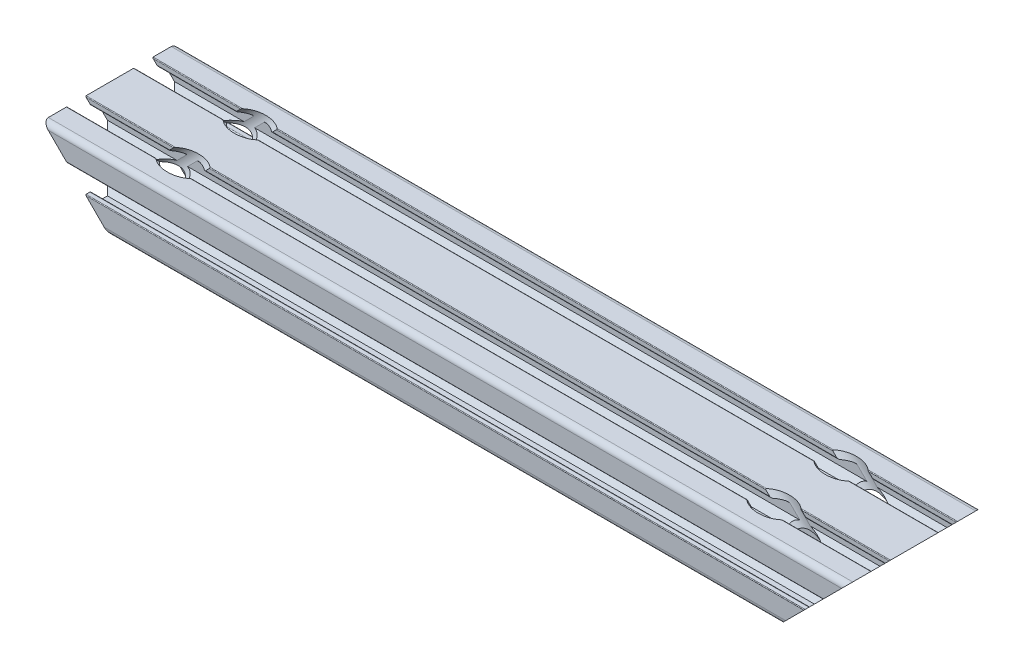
from build123d import *

# Parameters (mm, degrees)
MODEL_R                                 = 3.100002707
MODEL_R_2                               = 3.10000253
F_30_SARJA_1_0012_30X60_1_DEPTH         = 360
CUT_EXTRUDE1_DEPTH                      = 191.328663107
F_8_5_8_5_DIAMETER_HOLE1_D              = 8.5
CBORE_FOR_M8_HEX_HEAD_BOLT2_D           = 8.4
CBORE_FOR_M8_HEX_HEAD_BOLT2_CBORE_D     = 14
CBORE_FOR_M8_HEX_HEAD_BOLT2_CBORE_DEPTH = 30


with BuildPart() as part:
    # Model → 30-sarja 1.0012 30X60_1 (new body)
    with BuildSketch(Plane(origin=(180, 0, 0), x_dir=(0, 1, 0), z_dir=(-1, 0, 0))):
        with BuildLine():
            Line((-6.799995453, -22.860655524), (-3.939340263, -19.999999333))
            Line((-3.939340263, -19.999999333), (3.939341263, -19.999999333))
            Line((3.939341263, -19.999999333), (6.799995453, -22.860655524))
            Line((6.799995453, -22.860655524), (6.799995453, -27.200002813))
            ThreePointArc((6.799995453, -27.200002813), (6.712129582, -27.412131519), (6.500001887, -27.499999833))
            Line((6.500001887, -27.499999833), (4.60000176, -27.499999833))
            ThreePointArc((4.60000176, -27.499999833), (4.246448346, -27.646446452), (4.100001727, -27.999999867))
            Line((4.100001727, -27.999999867), (4.100001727, -29.69999698))
            ThreePointArc((4.100001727, -29.69999698), (4.187865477, -29.912129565), (4.399995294, -30))
            Line((4.399995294, -30), (12.499999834, -30))
            ThreePointArc((12.499999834, -30), (14.267766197, -29.267767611), (15, -27.500001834))
            Line((15, -27.500001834), (15, -19.400000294))
            ThreePointArc((15, -19.400000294), (14.912132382, -19.187867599), (14.69999998, -19.099999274))
            Line((14.69999998, -19.099999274), (12.999999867, -19.099999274))
            ThreePointArc((12.999999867, -19.099999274), (12.646446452, -19.246445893), (12.499999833, -19.599999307))
            Line((12.499999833, -19.599999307), (12.499999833, -21.499999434))
            ThreePointArc((12.499999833, -21.499999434), (12.41213274, -21.712129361), (12.200002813, -21.799996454))
            Line((12.200002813, -21.799996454), (7.860654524, -21.799996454))
            Line((7.860654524, -21.799996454), (4.999999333, -18.939341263))
            Line((4.999999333, -18.939341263), (4.999999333, -11.060659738))
            Line((4.999999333, -11.060659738), (7.860654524, -8.200005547))
            Line((7.860654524, -8.200005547), (12.200002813, -8.200005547))
            ThreePointArc((12.200002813, -8.200005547), (12.41213274, -8.28787264), (12.499999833, -8.500002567))
            Line((12.499999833, -8.500002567), (12.499999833, -10.400002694))
            ThreePointArc((12.499999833, -10.400002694), (12.646447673, -10.753553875), (12.999999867, -10.899999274))
            Line((12.999999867, -10.899999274), (14.70000098, -10.899999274))
            ThreePointArc((14.70000098, -10.899999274), (14.912131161, -10.81213217), (15, -10.600002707))
            Line((15, -10.600002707), (15, 10.600002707))
            ThreePointArc((15, 10.600002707), (14.912132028, 10.812134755), (14.69999998, 10.900002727))
            Line((14.69999998, 10.900002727), (12.999999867, 10.900002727))
            ThreePointArc((12.999999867, 10.900002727), (12.646446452, 10.753556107), (12.499999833, 10.400002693))
            Line((12.499999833, 10.400002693), (12.499999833, 8.500002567))
            ThreePointArc((12.499999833, 8.500002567), (12.41213274, 8.287872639), (12.200002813, 8.200005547))
            Line((12.200002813, 8.200005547), (7.860654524, 8.200005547))
            Line((7.860654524, 8.200005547), (4.999999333, 11.060661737))
            Line((4.999999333, 11.060661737), (4.999999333, 18.939340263))
            Line((4.999999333, 18.939340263), (7.860654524, 21.799996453))
            Line((7.860654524, 21.799996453), (12.200002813, 21.799996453))
            ThreePointArc((12.200002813, 21.799996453), (12.41213274, 21.712129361), (12.499999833, 21.499999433))
            Line((12.499999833, 21.499999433), (12.499999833, 19.599999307))
            ThreePointArc((12.499999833, 19.599999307), (12.646447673, 19.246448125), (12.999999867, 19.100002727))
            Line((12.999999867, 19.100002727), (14.70000098, 19.100002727))
            ThreePointArc((14.70000098, 19.100002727), (14.912131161, 19.187869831), (15, 19.399999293))
            Line((15, 19.399999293), (15, 27.500001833))
            ThreePointArc((15, 27.500001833), (14.267766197, 29.267767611), (12.499999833, 30))
            Line((12.499999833, 30), (4.399993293, 30))
            ThreePointArc((4.399993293, 30), (4.187866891, 29.912130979), (4.100001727, 29.70000298))
            Line((4.100001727, 29.70000298), (4.100001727, 27.999999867))
            ThreePointArc((4.100001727, 27.999999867), (4.246448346, 27.646446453), (4.60000176, 27.499999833))
            Line((4.60000176, 27.499999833), (6.500001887, 27.499999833))
            ThreePointArc((6.500001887, 27.499999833), (6.712129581, 27.41213152), (6.799995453, 27.200002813))
            Line((6.799995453, 27.200002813), (6.799995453, 22.860656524))
            Line((6.799995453, 22.860656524), (3.939341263, 19.999999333))
            Line((3.939341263, 19.999999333), (-3.939340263, 19.999999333))
            Line((-3.939340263, 19.999999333), (-6.799995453, 22.860656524))
            Line((-6.799995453, 22.860656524), (-6.799995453, 27.200002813))
            ThreePointArc((-6.799995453, 27.200002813), (-6.712128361, 27.41213274), (-6.499998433, 27.499999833))
            Line((-6.499998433, 27.499999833), (-4.599998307, 27.499999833))
            ThreePointArc((-4.599998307, 27.499999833), (-4.246444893, 27.646446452), (-4.099998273, 27.999999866))
            Line((-4.099998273, 27.999999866), (-4.099998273, 29.69999698))
            ThreePointArc((-4.099998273, 29.69999698), (-4.187863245, 29.912130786), (-4.399995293, 30))
            Line((-4.399995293, 30), (-12.499999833, 30))
            ThreePointArc((-12.499999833, 30), (-14.267766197, 29.267767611), (-15, 27.500001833))
            Line((-15, 27.500001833), (-15, 19.399999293))
            ThreePointArc((-15, 19.399999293), (-14.912130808, 19.187869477), (-14.69999998, 19.100002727))
            Line((-14.69999998, 19.100002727), (-12.999999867, 19.100002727))
            ThreePointArc((-12.999999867, 19.100002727), (-12.646446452, 19.246449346), (-12.499999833, 19.60000276))
            Line((-12.499999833, 19.60000276), (-12.499999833, 21.500002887))
            ThreePointArc((-12.499999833, 21.500002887), (-12.41213152, 21.712130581), (-12.200002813, 21.799996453))
            Line((-12.200002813, 21.799996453), (-7.860655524, 21.799996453))
            Line((-7.860655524, 21.799996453), (-4.999999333, 18.939340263))
            Line((-4.999999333, 18.939340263), (-4.999999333, 11.060661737))
            Line((-4.999999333, 11.060661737), (-7.860655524, 8.200005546))
            Line((-7.860655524, 8.200005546), (-12.200002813, 8.200005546))
            ThreePointArc((-12.200002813, 8.200005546), (-12.41213274, 8.287872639), (-12.499999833, 8.500002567))
            Line((-12.499999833, 8.500002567), (-12.499999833, 10.400002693))
            ThreePointArc((-12.499999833, 10.400002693), (-12.646446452, 10.753556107), (-12.999999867, 10.900002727))
            Line((-12.999999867, 10.900002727), (-14.69999998, 10.900002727))
            ThreePointArc((-14.69999998, 10.900002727), (-14.912132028, 10.812134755), (-15, 10.600002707))
            Line((-15, 10.600002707), (-15, -10.600002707))
            ThreePointArc((-15, -10.600002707), (-14.912130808, -10.812132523), (-14.69999998, -10.899999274))
            Line((-14.69999998, -10.899999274), (-12.999999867, -10.899999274))
            ThreePointArc((-12.999999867, -10.899999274), (-12.646446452, -10.753552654), (-12.499999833, -10.39999924))
            Line((-12.499999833, -10.39999924), (-12.499999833, -8.499999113))
            ThreePointArc((-12.499999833, -8.499999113), (-12.41213152, -8.287871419), (-12.200002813, -8.200005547))
            Line((-12.200002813, -8.200005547), (-7.860655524, -8.200005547))
            Line((-7.860655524, -8.200005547), (-4.999999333, -11.060659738))
            Line((-4.999999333, -11.060659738), (-4.999999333, -18.939341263))
            Line((-4.999999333, -18.939341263), (-7.860655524, -21.799996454))
            Line((-7.860655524, -21.799996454), (-12.200002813, -21.799996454))
            ThreePointArc((-12.200002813, -21.799996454), (-12.41213274, -21.712129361), (-12.499999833, -21.499999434))
            Line((-12.499999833, -21.499999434), (-12.499999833, -19.599999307))
            ThreePointArc((-12.499999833, -19.599999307), (-12.646446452, -19.246445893), (-12.999999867, -19.099999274))
            Line((-12.999999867, -19.099999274), (-14.69999998, -19.099999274))
            ThreePointArc((-14.69999998, -19.099999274), (-14.912132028, -19.187867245), (-15, -19.399999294))
            Line((-15, -19.399999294), (-15, -27.500001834))
            ThreePointArc((-15, -27.500001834), (-14.267766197, -29.267767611), (-12.499999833, -30))
            Line((-12.499999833, -30), (-4.399993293, -30))
            ThreePointArc((-4.399993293, -30), (-4.187864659, -29.9121322), (-4.099998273, -29.70000298))
            Line((-4.099998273, -29.70000298), (-4.099998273, -27.999999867))
            ThreePointArc((-4.099998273, -27.999999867), (-4.246444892, -27.646446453), (-4.599998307, -27.499999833))
            Line((-4.599998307, -27.499999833), (-6.499998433, -27.499999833))
            ThreePointArc((-6.499998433, -27.499999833), (-6.712128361, -27.412132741), (-6.799995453, -27.200002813))
            Line((-6.799995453, -27.200002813), (-6.799995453, -22.860655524))
        make_face()
        with Locations((10.900000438, 25.899998)):
            Circle(MODEL_R, mode=Mode.SUBTRACT)
        with Locations((-10.899999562, -25.900002)):
            Circle(MODEL_R, mode=Mode.SUBTRACT)
        with Locations((10.900000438, -25.900002)):
            Circle(MODEL_R, mode=Mode.SUBTRACT)
        with Locations((-10.899999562, 25.899998)):
            Circle(MODEL_R_2, mode=Mode.SUBTRACT)
        with BuildLine():
            Line((-2.08578666, 18.499997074), (-2.999999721, 18.499997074))
            ThreePointArc((-2.999999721, 18.499997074), (-3.353553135, 18.353550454), (-3.499999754, 17.99999704))
            Line((-3.499999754, 17.99999704), (-3.499999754, 17.085781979))
            Line((-3.499999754, 17.085781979), (-3.363292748, 16.949078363))
            ThreePointArc((-3.363292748, 16.949078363), (-3.279575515, 16.786690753), (-3.305578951, 16.605853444))
            ThreePointArc((-3.305578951, 16.605853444), (-3.674999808, 14.999997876), (-3.305578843, 13.394142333))
            ThreePointArc((-3.305578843, 13.394142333), (-3.279575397, 13.213305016), (-3.363292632, 13.050917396))
            Line((-3.363292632, 13.050917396), (-3.499999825, 12.914213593))
            Line((-3.499999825, 12.914213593), (-3.499999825, 11.999998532))
            ThreePointArc((-3.499999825, 11.999998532), (-3.353553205, 11.646445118), (-2.999999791, 11.499998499))
            Line((-2.999999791, 11.499998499), (-2.08578673, 11.499998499))
            Line((-2.08578673, 11.499998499), (-1.949080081, 11.636706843))
            ThreePointArc((-1.949080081, 11.636706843), (-1.786692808, 11.720422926), (-1.605856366, 11.694419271))
            ThreePointArc((-1.605856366, 11.694419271), (-1.44e-07, 11.324997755), (1.605856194, 11.694418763))
            ThreePointArc((1.605856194, 11.694418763), (1.786693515, 11.720422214), (1.949081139, 11.636704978))
            Line((1.949081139, 11.636704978), (2.085785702, 11.499997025))
            Line((2.085785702, 11.499997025), (2.999998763, 11.499997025))
            ThreePointArc((2.999998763, 11.499997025), (3.353552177, 11.646443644), (3.499998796, 11.999997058))
            Line((3.499998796, 11.999997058), (3.499998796, 12.914212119))
            Line((3.499998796, 12.914212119), (3.363292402, 13.050915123))
            ThreePointArc((3.363292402, 13.050915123), (3.279575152, 13.213302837), (3.305578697, 13.394140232))
            ThreePointArc((3.305578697, 13.394140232), (3.675000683, 14.999998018), (3.305578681, 16.605855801))
            ThreePointArc((3.305578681, 16.605855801), (3.279575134, 16.786693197), (3.363292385, 16.949080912))
            Line((3.363292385, 16.949080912), (3.499998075, 17.085783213))
            Line((3.499998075, 17.085783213), (3.499998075, 17.999998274))
            ThreePointArc((3.499998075, 17.999998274), (3.353551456, 18.353551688), (2.999998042, 18.499998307))
            Line((2.999998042, 18.499998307), (2.085784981, 18.499998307))
            Line((2.085784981, 18.499998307), (1.949081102, 18.363291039))
            ThreePointArc((1.949081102, 18.363291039), (1.78669348, 18.279573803), (1.60585616, 18.305577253))
            ThreePointArc((1.60585616, 18.305577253), (-2.86e-07, 18.674998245), (-1.605856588, 18.30557662))
            ThreePointArc((-1.605856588, 18.30557662), (-1.786693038, 18.279572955), (-1.949080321, 18.363289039))
            Line((-1.949080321, 18.363289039), (-2.08578666, 18.499997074))
        make_face(mode=Mode.SUBTRACT)
        with BuildLine():
            Line((-3.525125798, -10.000002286), (3.525126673, -10.000002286))
            ThreePointArc((3.525126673, -10.000002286), (3.907810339, -9.923881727), (4.23223382, -9.707108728))
            Line((4.23223382, -9.707108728), (6.446441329, -7.492899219))
            ThreePointArc((6.446441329, -7.492899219), (6.77086481, -7.27612622), (7.153548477, -7.200005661))
            Line((7.153548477, -7.200005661), (13.4999999, -7.200005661))
            ThreePointArc((13.4999999, -7.200005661), (13.853553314, -7.053559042), (13.999999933, -6.700005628))
            Line((13.999999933, -6.700005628), (13.999999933, 6.700005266))
            ThreePointArc((13.999999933, 6.700005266), (13.853553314, 7.05355868), (13.4999999, 7.200005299))
            Line((13.4999999, 7.200005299), (7.153548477, 7.200005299))
            ThreePointArc((7.153548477, 7.200005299), (6.770865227, 7.27612566), (6.44644193, 7.492898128))
            Line((6.44644193, 7.492898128), (4.232233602, 9.707108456))
            ThreePointArc((4.232233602, 9.707108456), (3.90781002, 9.923881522), (3.525126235, 10.000002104))
            Line((3.525126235, 10.000002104), (-3.525126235, 10.000002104))
            ThreePointArc((-3.525126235, 10.000002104), (-3.907809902, 9.923881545), (-4.232233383, 9.707108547))
            Line((-4.232233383, 9.707108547), (-6.446440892, 7.492899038))
            ThreePointArc((-6.446440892, 7.492899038), (-6.770864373, 7.276126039), (-7.153548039, 7.20000548))
            Line((-7.153548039, 7.20000548), (-13.499999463, 7.20000548))
            ThreePointArc((-13.499999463, 7.20000548), (-13.853552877, 7.053558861), (-13.999999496, 6.700005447))
            Line((-13.999999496, 6.700005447), (-13.999999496, -6.700005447))
            ThreePointArc((-13.999999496, -6.700005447), (-13.853552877, -7.053558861), (-13.499999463, -7.20000548))
            Line((-13.499999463, -7.20000548), (-7.153548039, -7.20000548))
            ThreePointArc((-7.153548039, -7.20000548), (-6.770864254, -7.276126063), (-6.446440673, -7.492899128))
            Line((-6.446440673, -7.492899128), (-4.232233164, -9.707108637))
            ThreePointArc((-4.232233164, -9.707108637), (-3.907809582, -9.923881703), (-3.525125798, -10.000002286))
        make_face(mode=Mode.SUBTRACT)
        with BuildLine():
            Line((1.949081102, -18.363295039), (2.085784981, -18.500002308))
            Line((2.085784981, -18.500002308), (2.999998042, -18.500002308))
            ThreePointArc((2.999998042, -18.500002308), (3.353551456, -18.353555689), (3.499998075, -18.000002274))
            Line((3.499998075, -18.000002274), (3.499998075, -17.085787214))
            Line((3.499998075, -17.085787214), (3.363292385, -16.949084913))
            ThreePointArc((3.363292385, -16.949084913), (3.279575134, -16.786697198), (3.305578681, -16.605859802))
            ThreePointArc((3.305578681, -16.605859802), (3.675000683, -15.000002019), (3.305578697, -13.394144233))
            ThreePointArc((3.305578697, -13.394144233), (3.279575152, -13.213306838), (3.363292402, -13.050919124))
            Line((3.363292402, -13.050919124), (3.499998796, -12.91421612))
            Line((3.499998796, -12.91421612), (3.499998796, -12.000001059))
            ThreePointArc((3.499998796, -12.000001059), (3.353552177, -11.646447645), (2.999998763, -11.500001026))
            Line((2.999998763, -11.500001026), (2.085785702, -11.500001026))
            Line((2.085785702, -11.500001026), (1.949081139, -11.636708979))
            ThreePointArc((1.949081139, -11.636708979), (1.786693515, -11.720426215), (1.605856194, -11.694422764))
            ThreePointArc((1.605856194, -11.694422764), (-1.44e-07, -11.325001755), (-1.605856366, -11.694423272))
            ThreePointArc((-1.605856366, -11.694423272), (-1.786692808, -11.720426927), (-1.949080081, -11.636710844))
            Line((-1.949080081, -11.636710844), (-2.08578673, -11.5000025))
            Line((-2.08578673, -11.5000025), (-2.999999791, -11.5000025))
            ThreePointArc((-2.999999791, -11.5000025), (-3.353553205, -11.646449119), (-3.499999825, -12.000002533))
            Line((-3.499999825, -12.000002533), (-3.499999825, -12.914217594))
            Line((-3.499999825, -12.914217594), (-3.363292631, -13.050921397))
            ThreePointArc((-3.363292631, -13.050921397), (-3.279575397, -13.213309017), (-3.305578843, -13.394146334))
            ThreePointArc((-3.305578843, -13.394146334), (-3.674999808, -15.000001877), (-3.305578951, -16.605857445))
            ThreePointArc((-3.305578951, -16.605857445), (-3.279575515, -16.786694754), (-3.363292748, -16.949082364))
            Line((-3.363292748, -16.949082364), (-3.499999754, -17.08578598))
            Line((-3.499999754, -17.08578598), (-3.499999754, -18.000001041))
            ThreePointArc((-3.499999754, -18.000001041), (-3.353553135, -18.353554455), (-2.999999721, -18.500001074))
            Line((-2.999999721, -18.500001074), (-2.08578666, -18.500001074))
            Line((-2.08578666, -18.500001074), (-1.949080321, -18.36329304))
            ThreePointArc((-1.949080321, -18.36329304), (-1.786693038, -18.279576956), (-1.605856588, -18.305580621))
            ThreePointArc((-1.605856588, -18.305580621), (-2.86e-07, -18.675002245), (1.60585616, -18.305581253))
            ThreePointArc((1.60585616, -18.305581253), (1.78669348, -18.279577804), (1.949081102, -18.363295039))
        make_face(mode=Mode.SUBTRACT)
    extrude(amount=F_30_SARJA_1_0012_30X60_1_DEPTH)

    # Sketch2 → Cut-Extrude1 (cut, through all)
    with BuildSketch(Plane.XY.offset(30)):
        Polygon((180, 15), (150, -15), (180, -15), align=None)
        Polygon((-150, -15), (-180, -15), (-180, 15), align=None)
    extrude(amount=-CUT_EXTRUDE1_DEPTH, mode=Mode.SUBTRACT)

    # 8.5 _8.5_ Diameter Hole1 (through all)
    with Locations(Plane(origin=(82.5, -82.5, 0), x_dir=(0, 0, -1), z_dir=(0.7071067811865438, -0.7071067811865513, 0))):
        with Locations((-15.0000005, 104.101552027), (15.0000005, 104.101552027)):
            f_8_5_8_5_diameter_hole1 = Hole(F_8_5_8_5_DIAMETER_HOLE1_D / 2)

    # Mirror1: 8.5 _8.5_ Diameter Hole1 across plane
    add(f_8_5_8_5_diameter_hole1.mirror(Plane(origin=(0, 0, 0), x_dir=(0, 0, 1), z_dir=(1, 0, 0))), mode=Mode.SUBTRACT)

    # CBORE for M8 Hex Head Bolt2 (through all)
    with Locations(Plane(origin=(50.680194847, -50.680194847, 0), x_dir=(0, 0, -1), z_dir=(-0.7071067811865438, 0.7071067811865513, 0))):
        with Locations((15.0000005, -104.101552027), (-15.0000005, -104.101552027)):
            cbore_for_m8_hex_head_bolt2 = CounterBoreHole(CBORE_FOR_M8_HEX_HEAD_BOLT2_D / 2, CBORE_FOR_M8_HEX_HEAD_BOLT2_CBORE_D / 2, CBORE_FOR_M8_HEX_HEAD_BOLT2_CBORE_DEPTH)

    # Mirror2: CBORE for M8 Hex Head Bolt2 across plane
    add(cbore_for_m8_hex_head_bolt2.mirror(Plane(origin=(0, 0, 0), x_dir=(0, 0, 1), z_dir=(1, 0, 0))), mode=Mode.SUBTRACT)


solid = part.part
